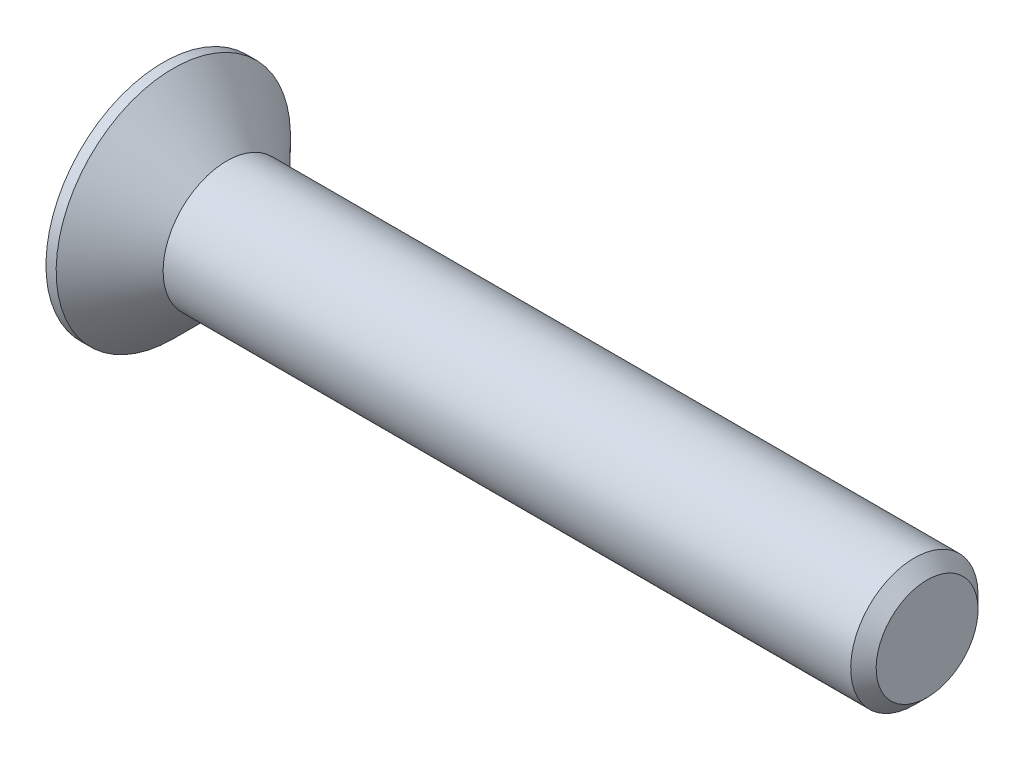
ISO-10303-21;
HEADER;
FILE_DESCRIPTION(('STEP AP214'),'2;1');
FILE_NAME('part.step','',(''),(''),'','','');
FILE_SCHEMA(('AUTOMOTIVE_DESIGN { 1 0 10303 214 1 1 1 1 }'));
ENDSEC;
DATA;
#1=APPLICATION_CONTEXT('core data for automotive mechanical design processes');
#2=APPLICATION_PROTOCOL_DEFINITION('international standard','automotive_design',2000,#1);
#3=PRODUCT_CONTEXT('',#1,'mechanical');
#4=PRODUCT('Part','Part','',(#3));
#5=PRODUCT_RELATED_PRODUCT_CATEGORY('part','',(#4));
#6=PRODUCT_DEFINITION_FORMATION('','',#4);
#7=PRODUCT_DEFINITION_CONTEXT('part definition',#1,'design');
#8=PRODUCT_DEFINITION('design','',#6,#7);
#9=PRODUCT_DEFINITION_SHAPE('','',#8);
#10=(LENGTH_UNIT() NAMED_UNIT(*) SI_UNIT(.MILLI.,.METRE.));
#11=(NAMED_UNIT(*) PLANE_ANGLE_UNIT() SI_UNIT($,.RADIAN.));
#12=(NAMED_UNIT(*) SI_UNIT($,.STERADIAN.) SOLID_ANGLE_UNIT());
#13=UNCERTAINTY_MEASURE_WITH_UNIT(LENGTH_MEASURE(1.E-05),#10,'distance_accuracy_value','');
#14=(GEOMETRIC_REPRESENTATION_CONTEXT(3) GLOBAL_UNCERTAINTY_ASSIGNED_CONTEXT((#13)) GLOBAL_UNIT_ASSIGNED_CONTEXT((#10,
#11,#12)) REPRESENTATION_CONTEXT('',''));
#15=CARTESIAN_POINT('',(0.,0.,0.));
#16=DIRECTION('',(0.,0.,1.));
#17=DIRECTION('',(1.,0.,0.));
#18=AXIS2_PLACEMENT_3D('',#15,#16,#17);
#19=CARTESIAN_POINT('',(0.,0.,0.));
#20=DIRECTION('',(-1.,0.,0.));
#21=DIRECTION('',(0.,-1.,0.));
#22=AXIS2_PLACEMENT_3D('',#19,#20,#21);
#23=CONICAL_SURFACE('',#22,2.5,0.78539816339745);
#24=CARTESIAN_POINT('',(-2.09999999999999,0.,0.));
#25=DIRECTION('',(-1.,0.,0.));
#26=DIRECTION('',(0.,-1.,0.));
#27=AXIS2_PLACEMENT_3D('',#24,#25,#26);
#28=CIRCLE('',#27,4.6);
#29=CARTESIAN_POINT('',(-2.09999999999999,-4.6,0.));
#30=VERTEX_POINT('',#29);
#31=EDGE_CURVE('E189',#30,#30,#28,.T.);
#32=ORIENTED_EDGE('',*,*,#31,.F.);
#33=EDGE_LOOP('',(#32));
#34=FACE_BOUND('',#33,.T.);
#35=CARTESIAN_POINT('',(0.,0.,0.));
#36=DIRECTION('',(-1.,0.,0.));
#37=DIRECTION('',(0.,-1.,0.));
#38=AXIS2_PLACEMENT_3D('',#35,#36,#37);
#39=CIRCLE('',#38,2.5);
#40=CARTESIAN_POINT('',(0.,-2.5,0.));
#41=VERTEX_POINT('',#40);
#42=EDGE_CURVE('E212',#41,#41,#39,.T.);
#43=ORIENTED_EDGE('',*,*,#42,.T.);
#44=EDGE_LOOP('',(#43));
#45=FACE_BOUND('',#44,.T.);
#46=ADVANCED_FACE('F33',(#34,#45),#23,.T.);
#47=CARTESIAN_POINT('',(-2.5,0.,0.));
#48=DIRECTION('',(-1.,0.,0.));
#49=DIRECTION('',(0.,-1.,0.));
#50=AXIS2_PLACEMENT_3D('',#47,#48,#49);
#51=CYLINDRICAL_SURFACE('',#50,2.5);
#52=CARTESIAN_POINT('',(27.,0.,0.));
#53=DIRECTION('',(-1.,0.,0.));
#54=DIRECTION('',(0.,-1.,0.));
#55=AXIS2_PLACEMENT_3D('',#52,#53,#54);
#56=CIRCLE('',#55,2.5);
#57=CARTESIAN_POINT('',(27.,-2.5,0.));
#58=VERTEX_POINT('',#57);
#59=EDGE_CURVE('E41',#58,#58,#56,.T.);
#60=ORIENTED_EDGE('',*,*,#59,.T.);
#61=EDGE_LOOP('',(#60));
#62=FACE_BOUND('',#61,.T.);
#63=ORIENTED_EDGE('',*,*,#42,.F.);
#64=EDGE_LOOP('',(#63));
#65=FACE_BOUND('',#64,.T.);
#66=ADVANCED_FACE('F217',(#62,#65),#51,.T.);
#67=CARTESIAN_POINT('',(27.5,0.,0.));
#68=DIRECTION('',(-1.,0.,0.));
#69=DIRECTION('',(0.,-1.,0.));
#70=AXIS2_PLACEMENT_3D('',#67,#68,#69);
#71=PLANE('',#70);
#72=CARTESIAN_POINT('',(27.5,0.,0.));
#73=DIRECTION('',(-1.,0.,0.));
#74=DIRECTION('',(0.,-1.,0.));
#75=AXIS2_PLACEMENT_3D('',#72,#73,#74);
#76=CIRCLE('',#75,1.99999999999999);
#77=CARTESIAN_POINT('',(27.5,-1.99999999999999,0.));
#78=VERTEX_POINT('',#77);
#79=EDGE_CURVE('E11',#78,#78,#76,.F.);
#80=ORIENTED_EDGE('',*,*,#79,.T.);
#81=EDGE_LOOP('',(#80));
#82=FACE_BOUND('',#81,.T.);
#83=ADVANCED_FACE('F239',(#82),#71,.F.);
#84=CARTESIAN_POINT('',(-2.5,4.6,0.));
#85=DIRECTION('',(1.,0.,0.));
#86=DIRECTION('',(0.,1.,0.));
#87=AXIS2_PLACEMENT_3D('',#84,#85,#86);
#88=PLANE('',#87);
#89=DIRECTION('',(0.,0.,-1.));
#90=VECTOR('',#89,1.);
#91=CARTESIAN_POINT('',(-2.5,0.575,-2.3));
#92=LINE('',#91,#90);
#93=CARTESIAN_POINT('',(-2.5,0.575,-0.575));
#94=VERTEX_POINT('',#93);
#95=CARTESIAN_POINT('',(-2.5,0.575,-2.3));
#96=VERTEX_POINT('',#95);
#97=EDGE_CURVE('E158',#94,#96,#92,.T.);
#98=ORIENTED_EDGE('',*,*,#97,.F.);
#99=DIRECTION('',(0.,-1.,0.));
#100=VECTOR('',#99,1.);
#101=CARTESIAN_POINT('',(-2.5,0.575,-0.575));
#102=LINE('',#101,#100);
#103=CARTESIAN_POINT('',(-2.5,2.3,-0.575));
#104=VERTEX_POINT('',#103);
#105=EDGE_CURVE('E48',#104,#94,#102,.T.);
#106=ORIENTED_EDGE('',*,*,#105,.F.);
#107=DIRECTION('',(0.,0.,-1.));
#108=VECTOR('',#107,1.);
#109=CARTESIAN_POINT('',(-2.5,2.3,-0.575));
#110=LINE('',#109,#108);
#111=CARTESIAN_POINT('',(-2.5,2.3,0.575));
#112=VERTEX_POINT('',#111);
#113=EDGE_CURVE('E185',#112,#104,#110,.T.);
#114=ORIENTED_EDGE('',*,*,#113,.F.);
#115=DIRECTION('',(0.,1.,0.));
#116=VECTOR('',#115,1.);
#117=CARTESIAN_POINT('',(-2.5,2.3,0.575));
#118=LINE('',#117,#116);
#119=CARTESIAN_POINT('',(-2.5,0.575,0.575));
#120=VERTEX_POINT('',#119);
#121=EDGE_CURVE('E183',#120,#112,#118,.T.);
#122=ORIENTED_EDGE('',*,*,#121,.F.);
#123=DIRECTION('',(0.,0.,-1.));
#124=VECTOR('',#123,1.);
#125=CARTESIAN_POINT('',(-2.5,0.575,0.575));
#126=LINE('',#125,#124);
#127=CARTESIAN_POINT('',(-2.5,0.575,2.3));
#128=VERTEX_POINT('',#127);
#129=EDGE_CURVE('E132',#128,#120,#126,.T.);
#130=ORIENTED_EDGE('',*,*,#129,.F.);
#131=DIRECTION('',(0.,1.,0.));
#132=VECTOR('',#131,1.);
#133=CARTESIAN_POINT('',(-2.5,0.575,2.3));
#134=LINE('',#133,#132);
#135=CARTESIAN_POINT('',(-2.5,-0.575,2.3));
#136=VERTEX_POINT('',#135);
#137=EDGE_CURVE('E179',#136,#128,#134,.T.);
#138=ORIENTED_EDGE('',*,*,#137,.F.);
#139=DIRECTION('',(0.,0.,1.));
#140=VECTOR('',#139,1.);
#141=CARTESIAN_POINT('',(-2.5,-0.575,2.3));
#142=LINE('',#141,#140);
#143=CARTESIAN_POINT('',(-2.5,-0.575,0.575));
#144=VERTEX_POINT('',#143);
#145=EDGE_CURVE('E176',#144,#136,#142,.T.);
#146=ORIENTED_EDGE('',*,*,#145,.F.);
#147=DIRECTION('',(0.,1.,0.));
#148=VECTOR('',#147,1.);
#149=CARTESIAN_POINT('',(-2.5,-0.575,0.575));
#150=LINE('',#149,#148);
#151=CARTESIAN_POINT('',(-2.5,-2.3,0.575));
#152=VERTEX_POINT('',#151);
#153=EDGE_CURVE('E173',#152,#144,#150,.T.);
#154=ORIENTED_EDGE('',*,*,#153,.F.);
#155=DIRECTION('',(0.,0.,1.));
#156=VECTOR('',#155,1.);
#157=CARTESIAN_POINT('',(-2.5,-2.3,0.575));
#158=LINE('',#157,#156);
#159=CARTESIAN_POINT('',(-2.5,-2.3,-0.575));
#160=VERTEX_POINT('',#159);
#161=EDGE_CURVE('E170',#160,#152,#158,.T.);
#162=ORIENTED_EDGE('',*,*,#161,.F.);
#163=DIRECTION('',(0.,-1.,0.));
#164=VECTOR('',#163,1.);
#165=CARTESIAN_POINT('',(-2.5,-2.3,-0.575));
#166=LINE('',#165,#164);
#167=CARTESIAN_POINT('',(-2.5,-0.575,-0.575));
#168=VERTEX_POINT('',#167);
#169=EDGE_CURVE('E167',#168,#160,#166,.T.);
#170=ORIENTED_EDGE('',*,*,#169,.F.);
#171=DIRECTION('',(0.,0.,1.));
#172=VECTOR('',#171,1.);
#173=CARTESIAN_POINT('',(-2.5,-0.575,-0.575));
#174=LINE('',#173,#172);
#175=CARTESIAN_POINT('',(-2.5,-0.575,-2.3));
#176=VERTEX_POINT('',#175);
#177=EDGE_CURVE('E164',#176,#168,#174,.T.);
#178=ORIENTED_EDGE('',*,*,#177,.F.);
#179=DIRECTION('',(0.,-1.,0.));
#180=VECTOR('',#179,1.);
#181=CARTESIAN_POINT('',(-2.5,-0.575,-2.3));
#182=LINE('',#181,#180);
#183=EDGE_CURVE('E161',#96,#176,#182,.T.);
#184=ORIENTED_EDGE('',*,*,#183,.F.);
#185=EDGE_LOOP('',(#98,#106,#114,#122,#130,#138,#146,#154,#162,#170,#178,#184));
#186=FACE_BOUND('',#185,.T.);
#187=CARTESIAN_POINT('',(-2.5,0.,0.));
#188=DIRECTION('',(-1.,0.,0.));
#189=DIRECTION('',(0.,-1.,0.));
#190=AXIS2_PLACEMENT_3D('',#187,#188,#189);
#191=CIRCLE('',#190,4.6);
#192=CARTESIAN_POINT('',(-2.5,-4.6,0.));
#193=VERTEX_POINT('',#192);
#194=EDGE_CURVE('E209',#193,#193,#191,.T.);
#195=ORIENTED_EDGE('',*,*,#194,.T.);
#196=EDGE_LOOP('',(#195));
#197=FACE_BOUND('',#196,.T.);
#198=ADVANCED_FACE('F230',(#186,#197),#88,.F.);
#199=CARTESIAN_POINT('',(-2.5,0.,0.));
#200=DIRECTION('',(-1.,0.,0.));
#201=DIRECTION('',(0.,-1.,0.));
#202=AXIS2_PLACEMENT_3D('',#199,#200,#201);
#203=CYLINDRICAL_SURFACE('',#202,4.6);
#204=ORIENTED_EDGE('',*,*,#194,.F.);
#205=EDGE_LOOP('',(#204));
#206=FACE_BOUND('',#205,.T.);
#207=ORIENTED_EDGE('',*,*,#31,.T.);
#208=EDGE_LOOP('',(#207));
#209=FACE_BOUND('',#208,.T.);
#210=ADVANCED_FACE('F222',(#206,#209),#203,.T.);
#211=CARTESIAN_POINT('',(27.,0.,0.));
#212=DIRECTION('',(-1.,0.,0.));
#213=DIRECTION('',(0.,-1.,0.));
#214=AXIS2_PLACEMENT_3D('',#211,#212,#213);
#215=CONICAL_SURFACE('',#214,2.5,0.785398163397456);
#216=ORIENTED_EDGE('',*,*,#79,.F.);
#217=EDGE_LOOP('',(#216));
#218=FACE_BOUND('',#217,.T.);
#219=ORIENTED_EDGE('',*,*,#59,.F.);
#220=EDGE_LOOP('',(#219));
#221=FACE_BOUND('',#220,.T.);
#222=ADVANCED_FACE('F35',(#218,#221),#215,.T.);
#223=CARTESIAN_POINT('',(-0.4,0.575,-0.575));
#224=DIRECTION('',(0.,0.,-1.));
#225=DIRECTION('',(-1.,0.,0.));
#226=AXIS2_PLACEMENT_3D('',#223,#224,#225);
#227=PLANE('',#226);
#228=ORIENTED_EDGE('',*,*,#105,.T.);
#229=DIRECTION('',(-1.,0.,0.));
#230=VECTOR('',#229,1.);
#231=CARTESIAN_POINT('',(-0.4,0.575,-0.575));
#232=LINE('',#231,#230);
#233=CARTESIAN_POINT('',(-0.4,0.575,-0.575));
#234=VERTEX_POINT('',#233);
#235=EDGE_CURVE('E96',#234,#94,#232,.T.);
#236=ORIENTED_EDGE('',*,*,#235,.F.);
#237=DIRECTION('',(0.,-1.,0.));
#238=VECTOR('',#237,1.);
#239=CARTESIAN_POINT('',(-0.4,0.575,-0.575));
#240=LINE('',#239,#238);
#241=CARTESIAN_POINT('',(-0.4,2.3,-0.575));
#242=VERTEX_POINT('',#241);
#243=EDGE_CURVE('E187',#242,#234,#240,.T.);
#244=ORIENTED_EDGE('',*,*,#243,.F.);
#245=DIRECTION('',(-1.,0.,0.));
#246=VECTOR('',#245,1.);
#247=CARTESIAN_POINT('',(-0.4,2.3,-0.575));
#248=LINE('',#247,#246);
#249=EDGE_CURVE('E56',#242,#104,#248,.T.);
#250=ORIENTED_EDGE('',*,*,#249,.T.);
#251=EDGE_LOOP('',(#228,#236,#244,#250));
#252=FACE_BOUND('',#251,.T.);
#253=ADVANCED_FACE('F221',(#252),#227,.F.);
#254=CARTESIAN_POINT('',(-0.4,2.3,-0.575));
#255=DIRECTION('',(0.,1.,0.));
#256=DIRECTION('',(-1.,0.,0.));
#257=AXIS2_PLACEMENT_3D('',#254,#255,#256);
#258=PLANE('',#257);
#259=ORIENTED_EDGE('',*,*,#113,.T.);
#260=ORIENTED_EDGE('',*,*,#249,.F.);
#261=DIRECTION('',(0.,0.,-1.));
#262=VECTOR('',#261,1.);
#263=CARTESIAN_POINT('',(-0.4,2.3,-0.575));
#264=LINE('',#263,#262);
#265=CARTESIAN_POINT('',(-0.4,2.3,0.575));
#266=VERTEX_POINT('',#265);
#267=EDGE_CURVE('E144',#266,#242,#264,.T.);
#268=ORIENTED_EDGE('',*,*,#267,.F.);
#269=DIRECTION('',(-1.,0.,0.));
#270=VECTOR('',#269,1.);
#271=CARTESIAN_POINT('',(-0.4,2.3,0.575));
#272=LINE('',#271,#270);
#273=EDGE_CURVE('E136',#266,#112,#272,.T.);
#274=ORIENTED_EDGE('',*,*,#273,.T.);
#275=EDGE_LOOP('',(#259,#260,#268,#274));
#276=FACE_BOUND('',#275,.T.);
#277=ADVANCED_FACE('F228',(#276),#258,.F.);
#278=CARTESIAN_POINT('',(-0.4,2.3,0.575));
#279=DIRECTION('',(0.,0.,1.));
#280=DIRECTION('',(1.,0.,0.));
#281=AXIS2_PLACEMENT_3D('',#278,#279,#280);
#282=PLANE('',#281);
#283=ORIENTED_EDGE('',*,*,#121,.T.);
#284=ORIENTED_EDGE('',*,*,#273,.F.);
#285=DIRECTION('',(0.,1.,0.));
#286=VECTOR('',#285,1.);
#287=CARTESIAN_POINT('',(-0.4,2.3,0.575));
#288=LINE('',#287,#286);
#289=CARTESIAN_POINT('',(-0.4,0.575,0.575));
#290=VERTEX_POINT('',#289);
#291=EDGE_CURVE('E140',#290,#266,#288,.T.);
#292=ORIENTED_EDGE('',*,*,#291,.F.);
#293=DIRECTION('',(-1.,0.,0.));
#294=VECTOR('',#293,1.);
#295=CARTESIAN_POINT('',(-0.4,0.575,0.575));
#296=LINE('',#295,#294);
#297=EDGE_CURVE('E125',#290,#120,#296,.T.);
#298=ORIENTED_EDGE('',*,*,#297,.T.);
#299=EDGE_LOOP('',(#283,#284,#292,#298));
#300=FACE_BOUND('',#299,.T.);
#301=ADVANCED_FACE('F141',(#300),#282,.F.);
#302=CARTESIAN_POINT('',(-0.4,0.575,0.575));
#303=DIRECTION('',(0.,1.,0.));
#304=DIRECTION('',(-1.,0.,0.));
#305=AXIS2_PLACEMENT_3D('',#302,#303,#304);
#306=PLANE('',#305);
#307=ORIENTED_EDGE('',*,*,#129,.T.);
#308=ORIENTED_EDGE('',*,*,#297,.F.);
#309=DIRECTION('',(0.,0.,-1.));
#310=VECTOR('',#309,1.);
#311=CARTESIAN_POINT('',(-0.4,0.575,0.575));
#312=LINE('',#311,#310);
#313=CARTESIAN_POINT('',(-0.4,0.575,2.3));
#314=VERTEX_POINT('',#313);
#315=EDGE_CURVE('E129',#314,#290,#312,.T.);
#316=ORIENTED_EDGE('',*,*,#315,.F.);
#317=DIRECTION('',(-1.,0.,0.));
#318=VECTOR('',#317,1.);
#319=CARTESIAN_POINT('',(-0.4,0.575,2.3));
#320=LINE('',#319,#318);
#321=EDGE_CURVE('E137',#314,#128,#320,.T.);
#322=ORIENTED_EDGE('',*,*,#321,.T.);
#323=EDGE_LOOP('',(#307,#308,#316,#322));
#324=FACE_BOUND('',#323,.T.);
#325=ADVANCED_FACE('F127',(#324),#306,.F.);
#326=CARTESIAN_POINT('',(-0.4,0.575,2.3));
#327=DIRECTION('',(0.,0.,1.));
#328=DIRECTION('',(1.,0.,0.));
#329=AXIS2_PLACEMENT_3D('',#326,#327,#328);
#330=PLANE('',#329);
#331=ORIENTED_EDGE('',*,*,#137,.T.);
#332=ORIENTED_EDGE('',*,*,#321,.F.);
#333=DIRECTION('',(0.,1.,0.));
#334=VECTOR('',#333,1.);
#335=CARTESIAN_POINT('',(-0.4,0.575,2.3));
#336=LINE('',#335,#334);
#337=CARTESIAN_POINT('',(-0.4,-0.575,2.3));
#338=VERTEX_POINT('',#337);
#339=EDGE_CURVE('E150',#338,#314,#336,.T.);
#340=ORIENTED_EDGE('',*,*,#339,.F.);
#341=DIRECTION('',(-1.,0.,0.));
#342=VECTOR('',#341,1.);
#343=CARTESIAN_POINT('',(-0.4,-0.575,2.3));
#344=LINE('',#343,#342);
#345=EDGE_CURVE('E192',#338,#136,#344,.T.);
#346=ORIENTED_EDGE('',*,*,#345,.T.);
#347=EDGE_LOOP('',(#331,#332,#340,#346));
#348=FACE_BOUND('',#347,.T.);
#349=ADVANCED_FACE('F277',(#348),#330,.F.);
#350=CARTESIAN_POINT('',(-0.4,-0.575,2.3));
#351=DIRECTION('',(0.,-1.,0.));
#352=DIRECTION('',(1.,0.,0.));
#353=AXIS2_PLACEMENT_3D('',#350,#351,#352);
#354=PLANE('',#353);
#355=ORIENTED_EDGE('',*,*,#145,.T.);
#356=ORIENTED_EDGE('',*,*,#345,.F.);
#357=DIRECTION('',(0.,0.,1.));
#358=VECTOR('',#357,1.);
#359=CARTESIAN_POINT('',(-0.4,-0.575,2.3));
#360=LINE('',#359,#358);
#361=CARTESIAN_POINT('',(-0.4,-0.575,0.575));
#362=VERTEX_POINT('',#361);
#363=EDGE_CURVE('E152',#362,#338,#360,.T.);
#364=ORIENTED_EDGE('',*,*,#363,.F.);
#365=DIRECTION('',(-1.,0.,0.));
#366=VECTOR('',#365,1.);
#367=CARTESIAN_POINT('',(-0.4,-0.575,0.575));
#368=LINE('',#367,#366);
#369=EDGE_CURVE('E194',#362,#144,#368,.T.);
#370=ORIENTED_EDGE('',*,*,#369,.T.);
#371=EDGE_LOOP('',(#355,#356,#364,#370));
#372=FACE_BOUND('',#371,.T.);
#373=ADVANCED_FACE('F273',(#372),#354,.F.);
#374=CARTESIAN_POINT('',(-0.4,-0.575,0.575));
#375=DIRECTION('',(0.,0.,1.));
#376=DIRECTION('',(1.,0.,0.));
#377=AXIS2_PLACEMENT_3D('',#374,#375,#376);
#378=PLANE('',#377);
#379=ORIENTED_EDGE('',*,*,#153,.T.);
#380=ORIENTED_EDGE('',*,*,#369,.F.);
#381=DIRECTION('',(0.,1.,0.));
#382=VECTOR('',#381,1.);
#383=CARTESIAN_POINT('',(-0.4,-0.575,0.575));
#384=LINE('',#383,#382);
#385=CARTESIAN_POINT('',(-0.4,-2.3,0.575));
#386=VERTEX_POINT('',#385);
#387=EDGE_CURVE('E422',#386,#362,#384,.T.);
#388=ORIENTED_EDGE('',*,*,#387,.F.);
#389=DIRECTION('',(-1.,0.,0.));
#390=VECTOR('',#389,1.);
#391=CARTESIAN_POINT('',(-0.4,-2.3,0.575));
#392=LINE('',#391,#390);
#393=EDGE_CURVE('E196',#386,#152,#392,.T.);
#394=ORIENTED_EDGE('',*,*,#393,.T.);
#395=EDGE_LOOP('',(#379,#380,#388,#394));
#396=FACE_BOUND('',#395,.T.);
#397=ADVANCED_FACE('F269',(#396),#378,.F.);
#398=CARTESIAN_POINT('',(-0.4,-2.3,0.575));
#399=DIRECTION('',(0.,-1.,0.));
#400=DIRECTION('',(1.,0.,0.));
#401=AXIS2_PLACEMENT_3D('',#398,#399,#400);
#402=PLANE('',#401);
#403=ORIENTED_EDGE('',*,*,#161,.T.);
#404=ORIENTED_EDGE('',*,*,#393,.F.);
#405=DIRECTION('',(0.,0.,1.));
#406=VECTOR('',#405,1.);
#407=CARTESIAN_POINT('',(-0.4,-2.3,0.575));
#408=LINE('',#407,#406);
#409=CARTESIAN_POINT('',(-0.4,-2.3,-0.575));
#410=VERTEX_POINT('',#409);
#411=EDGE_CURVE('E419',#410,#386,#408,.T.);
#412=ORIENTED_EDGE('',*,*,#411,.F.);
#413=DIRECTION('',(-1.,0.,0.));
#414=VECTOR('',#413,1.);
#415=CARTESIAN_POINT('',(-0.4,-2.3,-0.575));
#416=LINE('',#415,#414);
#417=EDGE_CURVE('E198',#410,#160,#416,.T.);
#418=ORIENTED_EDGE('',*,*,#417,.T.);
#419=EDGE_LOOP('',(#403,#404,#412,#418));
#420=FACE_BOUND('',#419,.T.);
#421=ADVANCED_FACE('F265',(#420),#402,.F.);
#422=CARTESIAN_POINT('',(-0.4,-2.3,-0.575));
#423=DIRECTION('',(0.,0.,-1.));
#424=DIRECTION('',(-1.,0.,0.));
#425=AXIS2_PLACEMENT_3D('',#422,#423,#424);
#426=PLANE('',#425);
#427=ORIENTED_EDGE('',*,*,#169,.T.);
#428=ORIENTED_EDGE('',*,*,#417,.F.);
#429=DIRECTION('',(0.,-1.,0.));
#430=VECTOR('',#429,1.);
#431=CARTESIAN_POINT('',(-0.4,-2.3,-0.575));
#432=LINE('',#431,#430);
#433=CARTESIAN_POINT('',(-0.4,-0.575,-0.575));
#434=VERTEX_POINT('',#433);
#435=EDGE_CURVE('E416',#434,#410,#432,.T.);
#436=ORIENTED_EDGE('',*,*,#435,.F.);
#437=DIRECTION('',(-1.,0.,0.));
#438=VECTOR('',#437,1.);
#439=CARTESIAN_POINT('',(-0.4,-0.575,-0.575));
#440=LINE('',#439,#438);
#441=EDGE_CURVE('E200',#434,#168,#440,.T.);
#442=ORIENTED_EDGE('',*,*,#441,.T.);
#443=EDGE_LOOP('',(#427,#428,#436,#442));
#444=FACE_BOUND('',#443,.T.);
#445=ADVANCED_FACE('F261',(#444),#426,.F.);
#446=CARTESIAN_POINT('',(-0.4,-0.575,-0.575));
#447=DIRECTION('',(0.,-1.,0.));
#448=DIRECTION('',(1.,0.,0.));
#449=AXIS2_PLACEMENT_3D('',#446,#447,#448);
#450=PLANE('',#449);
#451=ORIENTED_EDGE('',*,*,#177,.T.);
#452=ORIENTED_EDGE('',*,*,#441,.F.);
#453=DIRECTION('',(0.,0.,1.));
#454=VECTOR('',#453,1.);
#455=CARTESIAN_POINT('',(-0.4,-0.575,-0.575));
#456=LINE('',#455,#454);
#457=CARTESIAN_POINT('',(-0.4,-0.575,-2.3));
#458=VERTEX_POINT('',#457);
#459=EDGE_CURVE('E413',#458,#434,#456,.T.);
#460=ORIENTED_EDGE('',*,*,#459,.F.);
#461=DIRECTION('',(-1.,0.,0.));
#462=VECTOR('',#461,1.);
#463=CARTESIAN_POINT('',(-0.4,-0.575,-2.3));
#464=LINE('',#463,#462);
#465=EDGE_CURVE('E202',#458,#176,#464,.T.);
#466=ORIENTED_EDGE('',*,*,#465,.T.);
#467=EDGE_LOOP('',(#451,#452,#460,#466));
#468=FACE_BOUND('',#467,.T.);
#469=ADVANCED_FACE('F257',(#468),#450,.F.);
#470=CARTESIAN_POINT('',(-0.4,-0.575,-2.3));
#471=DIRECTION('',(0.,0.,-1.));
#472=DIRECTION('',(-1.,0.,0.));
#473=AXIS2_PLACEMENT_3D('',#470,#471,#472);
#474=PLANE('',#473);
#475=ORIENTED_EDGE('',*,*,#183,.T.);
#476=ORIENTED_EDGE('',*,*,#465,.F.);
#477=DIRECTION('',(0.,-1.,0.));
#478=VECTOR('',#477,1.);
#479=CARTESIAN_POINT('',(-0.4,-0.575,-2.3));
#480=LINE('',#479,#478);
#481=CARTESIAN_POINT('',(-0.4,0.575,-2.3));
#482=VERTEX_POINT('',#481);
#483=EDGE_CURVE('E408',#482,#458,#480,.T.);
#484=ORIENTED_EDGE('',*,*,#483,.F.);
#485=DIRECTION('',(-1.,0.,0.));
#486=VECTOR('',#485,1.);
#487=CARTESIAN_POINT('',(-0.4,0.575,-2.3));
#488=LINE('',#487,#486);
#489=EDGE_CURVE('E204',#482,#96,#488,.T.);
#490=ORIENTED_EDGE('',*,*,#489,.T.);
#491=EDGE_LOOP('',(#475,#476,#484,#490));
#492=FACE_BOUND('',#491,.T.);
#493=ADVANCED_FACE('F253',(#492),#474,.F.);
#494=CARTESIAN_POINT('',(-0.4,0.575,-2.3));
#495=DIRECTION('',(0.,1.,0.));
#496=DIRECTION('',(-1.,0.,0.));
#497=AXIS2_PLACEMENT_3D('',#494,#495,#496);
#498=PLANE('',#497);
#499=ORIENTED_EDGE('',*,*,#97,.T.);
#500=ORIENTED_EDGE('',*,*,#489,.F.);
#501=DIRECTION('',(0.,0.,-1.));
#502=VECTOR('',#501,1.);
#503=CARTESIAN_POINT('',(-0.4,0.575,-2.3));
#504=LINE('',#503,#502);
#505=EDGE_CURVE('E406',#234,#482,#504,.T.);
#506=ORIENTED_EDGE('',*,*,#505,.F.);
#507=ORIENTED_EDGE('',*,*,#235,.T.);
#508=EDGE_LOOP('',(#499,#500,#506,#507));
#509=FACE_BOUND('',#508,.T.);
#510=ADVANCED_FACE('F250',(#509),#498,.F.);
#511=CARTESIAN_POINT('',(-0.4,0.,0.));
#512=DIRECTION('',(1.,0.,0.));
#513=DIRECTION('',(0.,0.,-1.));
#514=AXIS2_PLACEMENT_3D('',#511,#512,#513);
#515=PLANE('',#514);
#516=ORIENTED_EDGE('',*,*,#243,.T.);
#517=ORIENTED_EDGE('',*,*,#505,.T.);
#518=ORIENTED_EDGE('',*,*,#483,.T.);
#519=ORIENTED_EDGE('',*,*,#459,.T.);
#520=ORIENTED_EDGE('',*,*,#435,.T.);
#521=ORIENTED_EDGE('',*,*,#411,.T.);
#522=ORIENTED_EDGE('',*,*,#387,.T.);
#523=ORIENTED_EDGE('',*,*,#363,.T.);
#524=ORIENTED_EDGE('',*,*,#339,.T.);
#525=ORIENTED_EDGE('',*,*,#315,.T.);
#526=ORIENTED_EDGE('',*,*,#291,.T.);
#527=ORIENTED_EDGE('',*,*,#267,.T.);
#528=EDGE_LOOP('',(#516,#517,#518,#519,#520,#521,#522,#523,#524,#525,#526,#527));
#529=FACE_BOUND('',#528,.T.);
#530=ADVANCED_FACE('F147',(#529),#515,.F.);
#531=CLOSED_SHELL('',(#46,#66,#83,#198,#210,#222,#253,#277,#301,#325,#349,#373,#397,#421,#445,
#469,#493,#510,#530));
#532=MANIFOLD_SOLID_BREP('B2',#531);
#533=ADVANCED_BREP_SHAPE_REPRESENTATION('',(#18,#532),#14);
#534=SHAPE_DEFINITION_REPRESENTATION(#9,#533);
ENDSEC;
END-ISO-10303-21;
